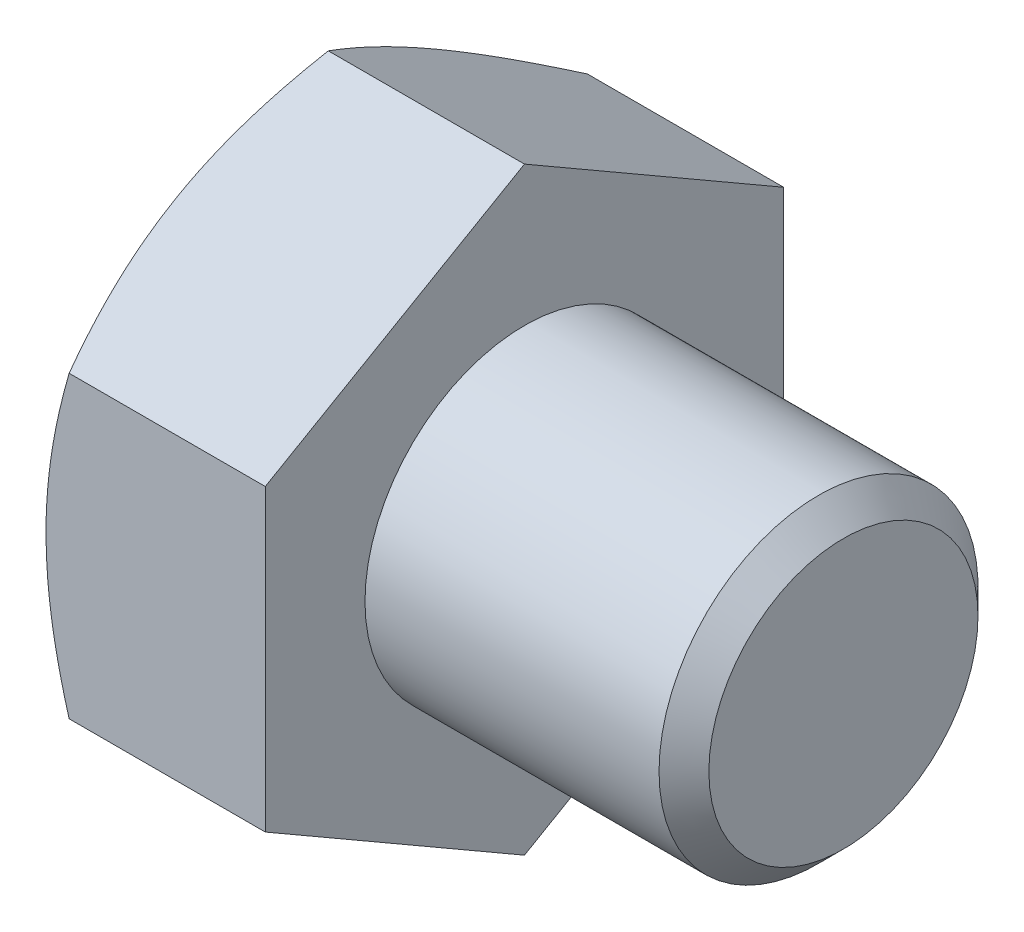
from build123d import *

# Parameters (mm, degrees)
EXTRUDE1_DEPTH = 5.5
SKETCH3_W      = 8
SKETCH3_H      = 4
CHAMFER1_SIZE  = 0.625


with BuildPart() as part:
    # Sketch2 → Extrude1 (new body)
    with BuildSketch(Plane(origin=(0, 0, 0), x_dir=(0, 0, -1), z_dir=(1, 0, 0))):
        Polygon((0, 7.505553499), (-6.5, 3.75277675), (-6.5, -3.75277675), (0, -7.505553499), (6.5, -3.75277675), (6.5, 3.75277675), align=None)
    extrude(amount=-EXTRUDE1_DEPTH)

    # Sketch3 → Revolve1 (revolve)
    with BuildSketch(Plane(origin=(0, 0, 0), x_dir=(1, 0, 0), z_dir=(0, 1, 0)), mode=Mode.PRIVATE) as revolve1_sk:
        with Locations((4, 2)):
            Rectangle(SKETCH3_W, SKETCH3_H)
    revolve(revolve1_sk.sketch.rotate(Axis((0, 0, 0), (1, 0, 0)), 180), axis=Axis((0, 0, 0), (1, 0, 0)))

    # Chamfer1
    chamfer1_edges = [part.edges().sort_by_distance(p)[0] for p in [
        (8, 0, -4),
    ]]
    chamfer(chamfer1_edges, length=CHAMFER1_SIZE)

    # Sketch4 → Cut-Revolve1 (revolve, cut)
    with BuildSketch(Plane.XY):
        Polygon((-5.5, 6.5), (-5.5, 7.505553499), (-4.919443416, 7.505553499), align=None)
    revolve(axis=Axis((0, 0, 0), (-1, 0, 0)), mode=Mode.SUBTRACT)


solid = part.part
